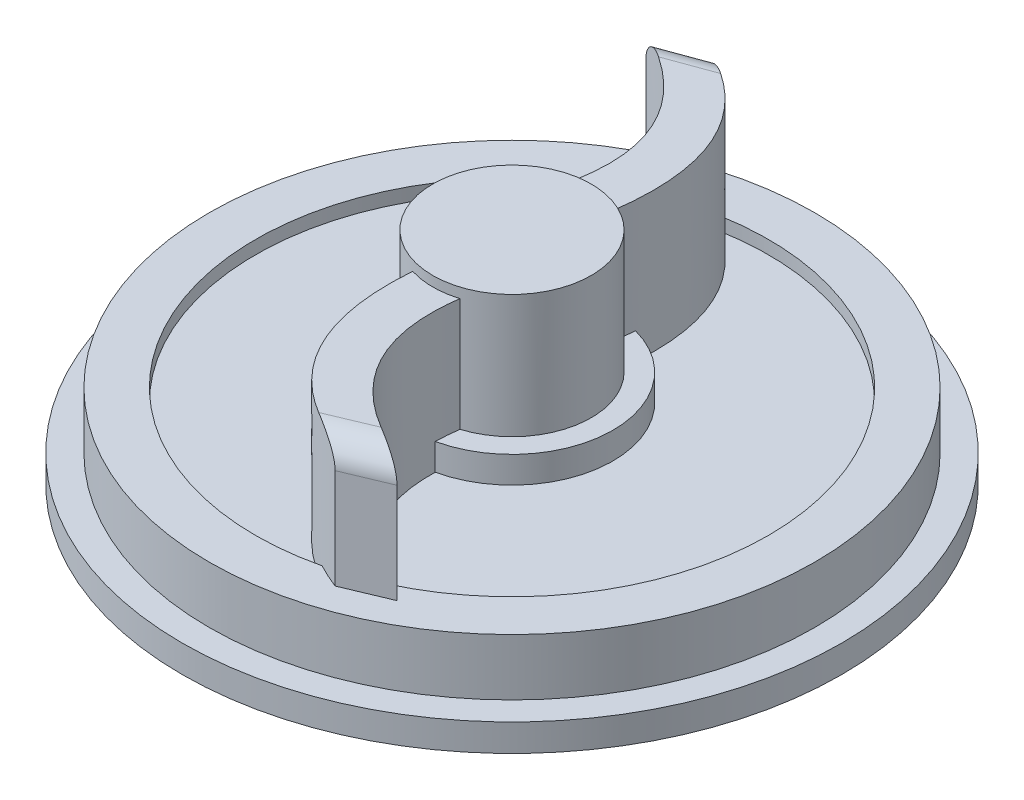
ISO-10303-21;
HEADER;
FILE_DESCRIPTION(('STEP AP214'),'2;1');
FILE_NAME('part.step','',(''),(''),'','','');
FILE_SCHEMA(('AUTOMOTIVE_DESIGN { 1 0 10303 214 1 1 1 1 }'));
ENDSEC;
DATA;
#1=APPLICATION_CONTEXT('core data for automotive mechanical design processes');
#2=APPLICATION_PROTOCOL_DEFINITION('international standard','automotive_design',2000,#1);
#3=PRODUCT_CONTEXT('',#1,'mechanical');
#4=PRODUCT('Part','Part','',(#3));
#5=PRODUCT_RELATED_PRODUCT_CATEGORY('part','',(#4));
#6=PRODUCT_DEFINITION_FORMATION('','',#4);
#7=PRODUCT_DEFINITION_CONTEXT('part definition',#1,'design');
#8=PRODUCT_DEFINITION('design','',#6,#7);
#9=PRODUCT_DEFINITION_SHAPE('','',#8);
#10=(LENGTH_UNIT() NAMED_UNIT(*) SI_UNIT(.MILLI.,.METRE.));
#11=(NAMED_UNIT(*) PLANE_ANGLE_UNIT() SI_UNIT($,.RADIAN.));
#12=(NAMED_UNIT(*) SI_UNIT($,.STERADIAN.) SOLID_ANGLE_UNIT());
#13=UNCERTAINTY_MEASURE_WITH_UNIT(LENGTH_MEASURE(1.E-05),#10,'distance_accuracy_value','');
#14=(GEOMETRIC_REPRESENTATION_CONTEXT(3) GLOBAL_UNCERTAINTY_ASSIGNED_CONTEXT((#13)) GLOBAL_UNIT_ASSIGNED_CONTEXT((#10,
#11,#12)) REPRESENTATION_CONTEXT('',''));
#15=CARTESIAN_POINT('',(0.,0.,0.));
#16=DIRECTION('',(0.,0.,1.));
#17=DIRECTION('',(1.,0.,0.));
#18=AXIS2_PLACEMENT_3D('',#15,#16,#17);
#19=CARTESIAN_POINT('',(-2.19994553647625,7.01039999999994,-9.2856290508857));
#20=DIRECTION('',(-0.939375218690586,0.,0.342890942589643));
#21=DIRECTION('',(0.342890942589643,0.,0.939375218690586));
#22=AXIS2_PLACEMENT_3D('',#19,#20,#21);
#23=CYLINDRICAL_SURFACE('',#22,1.016);
#24=DIRECTION('',(-0.939375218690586,0.,0.342890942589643));
#25=VECTOR('',#24,1.);
#26=CARTESIAN_POINT('',(-2.19994553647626,8.0264,-9.2856290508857));
#27=LINE('',#26,#25);
#28=CARTESIAN_POINT('',(-1.5618017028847,8.0264,-9.51856444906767));
#29=VERTEX_POINT('',#28);
#30=CARTESIAN_POINT('',(-3.29673498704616,8.0264,-8.88527873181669));
#31=VERTEX_POINT('',#30);
#32=EDGE_CURVE('E336',#29,#31,#27,.T.);
#33=ORIENTED_EDGE('',*,*,#32,.F.);
#34=CARTESIAN_POINT('',(-2.7509307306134,7.01039999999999,-10.1660782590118));
#35=CARTESIAN_POINT('',(-2.75093988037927,7.03324762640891,-10.1660813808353));
#36=CARTESIAN_POINT('',(-2.74991310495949,7.05608979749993,-10.1656295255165));
#37=CARTESIAN_POINT('',(-2.74585831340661,7.101539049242,-10.1638402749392));
#38=CARTESIAN_POINT('',(-2.74283226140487,7.12414633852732,-10.1625037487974));
#39=CARTESIAN_POINT('',(-2.73488806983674,7.1687295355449,-10.1589866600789));
#40=CARTESIAN_POINT('',(-2.72998860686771,7.19070944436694,-10.156814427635));
#41=CARTESIAN_POINT('',(-2.71841896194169,7.23409880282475,-10.1516676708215));
#42=CARTESIAN_POINT('',(-2.71174844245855,7.2555081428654,-10.1486929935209));
#43=CARTESIAN_POINT('',(-2.6893457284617,7.31850842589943,-10.1386612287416));
#44=CARTESIAN_POINT('',(-2.67118326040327,7.35907975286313,-10.1304793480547));
#45=CARTESIAN_POINT('',(-2.62959695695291,7.43682199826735,-10.111521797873));
#46=CARTESIAN_POINT('',(-2.60615907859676,7.47398346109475,-10.1007391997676));
#47=CARTESIAN_POINT('',(-2.54341022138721,7.56094330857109,-10.071461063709));
#48=CARTESIAN_POINT('',(-2.50177076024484,7.60863975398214,-10.0517044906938));
#49=CARTESIAN_POINT('',(-2.41260796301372,7.6961262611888,-10.0083441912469));
#50=CARTESIAN_POINT('',(-2.36507192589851,7.73589875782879,-9.9847321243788));
#51=CARTESIAN_POINT('',(-2.25060003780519,7.81905273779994,-9.92631224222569));
#52=CARTESIAN_POINT('',(-2.18225386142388,7.85965759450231,-9.89031505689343));
#53=CARTESIAN_POINT('',(-2.042000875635,7.92795943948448,-9.81351295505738));
#54=CARTESIAN_POINT('',(-1.97009407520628,7.95565646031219,-9.77270805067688));
#55=CARTESIAN_POINT('',(-1.84167675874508,7.99308049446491,-9.69679803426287));
#56=CARTESIAN_POINT('',(-1.78543052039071,8.00547589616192,-9.66254169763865));
#57=CARTESIAN_POINT('',(-1.67321876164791,8.02210958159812,-9.59200145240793));
#58=CARTESIAN_POINT('',(-1.61725289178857,8.02636910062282,-9.55572307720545));
#59=CARTESIAN_POINT('',(-1.5618017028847,8.0264,-9.51856444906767));
#60=B_SPLINE_CURVE_WITH_KNOTS('',3,(#34,#35,#36,#37,#38,#39,#40,#41,#42,#43,#44,#45,#46,#47,#48,
#49,#50,#51,#52,#53,#54,#55,#56,#57,#58,#59),.UNSPECIFIED.,.F.,.F.,(4,2,2,2,2,2,2,2,2,2,2,2,4),
(0.,0.06850652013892,0.13694583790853,0.204719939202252,0.272506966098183,0.407452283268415,
0.542761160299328,0.740634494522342,0.938941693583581,1.19940995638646,1.45987756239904,
1.66041474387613,1.8604277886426),.UNSPECIFIED.);
#61=CARTESIAN_POINT('',(-2.7509307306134,7.01039999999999,-10.1660782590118));
#62=VERTEX_POINT('',#61);
#63=EDGE_CURVE('E63',#62,#29,#60,.T.);
#64=ORIENTED_EDGE('',*,*,#63,.F.);
#65=DIRECTION('',(-0.939375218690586,0.,0.342890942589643));
#66=VECTOR('',#65,1.);
#67=CARTESIAN_POINT('',(-4.44499999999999,7.0104,-9.5477087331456));
#68=LINE('',#67,#66);
#69=CARTESIAN_POINT('',(-4.44499999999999,7.0104,-9.5477087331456));
#70=VERTEX_POINT('',#69);
#71=EDGE_CURVE('E333',#70,#62,#68,.F.);
#72=ORIENTED_EDGE('',*,*,#71,.F.);
#73=CARTESIAN_POINT('',(-3.29673498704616,8.0264,-8.88527873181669));
#74=CARTESIAN_POINT('',(-3.33236763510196,8.02639372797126,-8.9092731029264));
#75=CARTESIAN_POINT('',(-3.36815982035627,8.02461645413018,-8.93298332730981));
#76=CARTESIAN_POINT('',(-3.43984134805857,8.01760239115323,-8.97973016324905));
#77=CARTESIAN_POINT('',(-3.47573068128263,8.01236591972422,-9.00276683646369));
#78=CARTESIAN_POINT('',(-3.58371517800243,7.99149549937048,-9.071027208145));
#79=CARTESIAN_POINT('',(-3.655629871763,7.97070257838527,-9.11506775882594));
#80=CARTESIAN_POINT('',(-3.79884720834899,7.91495059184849,-9.20035419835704));
#81=CARTESIAN_POINT('',(-3.87006333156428,7.87957634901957,-9.24147283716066));
#82=CARTESIAN_POINT('',(-4.00653363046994,7.79454853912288,-9.31828740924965));
#83=CARTESIAN_POINT('',(-4.07180692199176,7.74494305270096,-9.35400099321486));
#84=CARTESIAN_POINT('',(-4.17037473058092,7.65175548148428,-9.40682087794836));
#85=CARTESIAN_POINT('',(-4.2066848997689,7.61250708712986,-9.42597964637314));
#86=CARTESIAN_POINT('',(-4.27361700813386,7.52806614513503,-9.46089832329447));
#87=CARTESIAN_POINT('',(-4.30424677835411,7.4828819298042,-9.47666291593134));
#88=CARTESIAN_POINT('',(-4.35296199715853,7.39579354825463,-9.5015243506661));
#89=CARTESIAN_POINT('',(-4.37231709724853,7.35480033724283,-9.51131331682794));
#90=CARTESIAN_POINT('',(-4.40472654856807,7.26981235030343,-9.52762695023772));
#91=CARTESIAN_POINT('',(-4.4177941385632,7.22582410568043,-9.53415847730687));
#92=CARTESIAN_POINT('',(-4.43307405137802,7.15300720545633,-9.54177935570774));
#93=CARTESIAN_POINT('',(-4.4375233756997,7.1247496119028,-9.54399304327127));
#94=CARTESIAN_POINT('',(-4.44349583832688,7.06780279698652,-9.54696171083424));
#95=CARTESIAN_POINT('',(-4.44501384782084,7.039112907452,-9.54771413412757));
#96=CARTESIAN_POINT('',(-4.44499999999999,7.0104,-9.5477087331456));
#97=B_SPLINE_CURVE_WITH_KNOTS('',3,(#73,#74,#75,#76,#77,#78,#79,#80,#81,#82,#83,#84,#85,#86,#87,
#88,#89,#90,#91,#92,#93,#94,#95,#96),.UNSPECIFIED.,.F.,.F.,(4,2,2,2,2,2,2,2,2,2,2,4),(0.,
0.128788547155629,0.257565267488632,0.516893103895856,0.78417976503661,1.05057381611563,
1.22041156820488,1.39001341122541,1.52860333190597,1.66690015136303,1.75279745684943,
1.8388449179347),.UNSPECIFIED.);
#98=EDGE_CURVE('E11',#31,#70,#97,.T.);
#99=ORIENTED_EDGE('',*,*,#98,.F.);
#100=EDGE_LOOP('',(#33,#64,#72,#99));
#101=FACE_BOUND('',#100,.T.);
#102=ADVANCED_FACE('F49',(#101),#23,.T.);
#103=CARTESIAN_POINT('',(0.950999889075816,7.0104,9.76713718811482));
#104=DIRECTION('',(0.922255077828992,0.,-0.386581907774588));
#105=DIRECTION('',(-0.386581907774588,0.,-0.922255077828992));
#106=AXIS2_PLACEMENT_3D('',#103,#104,#105);
#107=CYLINDRICAL_SURFACE('',#106,1.016);
#108=DIRECTION('',(0.922255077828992,0.,-0.386581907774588));
#109=VECTOR('',#108,1.);
#110=CARTESIAN_POINT('',(0.950999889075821,8.02640000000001,9.76713718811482));
#111=LINE('',#110,#109);
#112=CARTESIAN_POINT('',(1.96858929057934,8.0264,9.34059396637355));
#113=VERTEX_POINT('',#112);
#114=CARTESIAN_POINT('',(3.64632829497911,8.0264,8.63733565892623));
#115=VERTEX_POINT('',#114);
#116=EDGE_CURVE('E527',#113,#115,#111,.T.);
#117=ORIENTED_EDGE('',*,*,#116,.F.);
#118=CARTESIAN_POINT('',(3.18554190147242,7.0104,9.93213111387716));
#119=CARTESIAN_POINT('',(3.18555110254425,7.03327480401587,9.93213381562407));
#120=CARTESIAN_POINT('',(3.18450582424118,7.05614420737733,9.93172800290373));
#121=CARTESIAN_POINT('',(3.1803773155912,7.10164853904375,9.93012051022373));
#122=CARTESIAN_POINT('',(3.1772960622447,7.12428367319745,9.92891960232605));
#123=CARTESIAN_POINT('',(3.16920556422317,7.16892460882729,9.92575832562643));
#124=CARTESIAN_POINT('',(3.16421520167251,7.19093437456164,9.92380539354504));
#125=CARTESIAN_POINT('',(3.15242874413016,7.23438383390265,9.91917630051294));
#126=CARTESIAN_POINT('',(3.14563230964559,7.25582341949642,9.91650000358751));
#127=CARTESIAN_POINT('',(3.1228011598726,7.31891635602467,9.90746971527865));
#128=CARTESIAN_POINT('',(3.10428519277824,7.35955016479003,9.90009917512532));
#129=CARTESIAN_POINT('',(3.06186787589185,7.43741160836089,9.882999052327));
#130=CARTESIAN_POINT('',(3.03795227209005,7.47462985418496,9.87326322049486));
#131=CARTESIAN_POINT('',(2.97398400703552,7.56158899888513,9.8468276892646));
#132=CARTESIAN_POINT('',(2.93156172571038,7.60924136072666,9.82898229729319));
#133=CARTESIAN_POINT('',(2.84065853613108,7.69664323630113,9.78973328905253));
#134=CARTESIAN_POINT('',(2.79216465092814,7.73637533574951,9.76832201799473));
#135=CARTESIAN_POINT('',(2.67532787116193,7.81940872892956,9.71524690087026));
#136=CARTESIAN_POINT('',(2.60552085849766,7.85993928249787,9.68247095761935));
#137=CARTESIAN_POINT('',(2.46210265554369,7.92810604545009,9.61234344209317));
#138=CARTESIAN_POINT('',(2.38849130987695,7.95574172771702,9.57499168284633));
#139=CARTESIAN_POINT('',(2.25674847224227,7.99311633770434,9.50526176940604));
#140=CARTESIAN_POINT('',(2.19892509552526,8.00550228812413,9.47369859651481));
#141=CARTESIAN_POINT('',(2.08344443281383,8.02211787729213,9.40857792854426));
#142=CARTESIAN_POINT('',(2.02578711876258,8.0263693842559,9.375026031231));
#143=CARTESIAN_POINT('',(1.96858929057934,8.0264,9.34059396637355));
#144=B_SPLINE_CURVE_WITH_KNOTS('',3,(#118,#119,#120,#121,#122,#123,#124,#125,#126,#127,#128,
#129,#130,#131,#132,#133,#134,#135,#136,#137,#138,#139,#140,#141,#142,#143),.UNSPECIFIED.,.F.,
.F.,(4,2,2,2,2,2,2,2,2,2,2,2,4),(0.,0.0685881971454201,0.137109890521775,0.204970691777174,
0.272844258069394,0.407968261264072,0.543453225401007,0.741096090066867,0.939168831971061,
1.19919540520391,1.45923260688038,1.65982486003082,1.85987708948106),.UNSPECIFIED.);
#145=CARTESIAN_POINT('',(3.18554190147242,7.0104,9.93213111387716));
#146=VERTEX_POINT('',#145);
#147=EDGE_CURVE('E348',#146,#113,#144,.T.);
#148=ORIENTED_EDGE('',*,*,#147,.F.);
#149=DIRECTION('',(0.922255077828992,0.,-0.386581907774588));
#150=VECTOR('',#149,1.);
#151=CARTESIAN_POINT('',(4.84873670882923,7.01040000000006,9.23496930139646));
#152=LINE('',#151,#150);
#153=CARTESIAN_POINT('',(4.84873670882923,7.01040000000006,9.23496930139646));
#154=VERTEX_POINT('',#153);
#155=EDGE_CURVE('E530',#154,#146,#152,.F.);
#156=ORIENTED_EDGE('',*,*,#155,.F.);
#157=CARTESIAN_POINT('',(3.64632829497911,8.0264,8.63733565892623));
#158=CARTESIAN_POINT('',(3.68325949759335,8.02639381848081,8.65922942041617));
#159=CARTESIAN_POINT('',(3.72034227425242,8.02464609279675,8.68081700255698));
#160=CARTESIAN_POINT('',(3.79458801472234,8.01775614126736,8.72329115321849));
#161=CARTESIAN_POINT('',(3.83175096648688,8.01261439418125,8.7441778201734));
#162=CARTESIAN_POINT('',(3.94355428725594,7.99213627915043,8.80594597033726));
#163=CARTESIAN_POINT('',(4.01799263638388,7.97174924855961,8.84563055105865));
#164=CARTESIAN_POINT('',(4.16771501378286,7.9166246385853,8.92295520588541));
#165=CARTESIAN_POINT('',(4.24285721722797,7.88122422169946,8.96039565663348));
#166=CARTESIAN_POINT('',(4.38696363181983,7.79592522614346,9.03008862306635));
#167=CARTESIAN_POINT('',(4.45594730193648,7.74607459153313,9.06235775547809));
#168=CARTESIAN_POINT('',(4.55954582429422,7.65279499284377,9.10963659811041));
#169=CARTESIAN_POINT('',(4.59738089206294,7.61390951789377,9.12659381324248));
#170=CARTESIAN_POINT('',(4.66728118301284,7.53018304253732,9.15750580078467));
#171=CARTESIAN_POINT('',(4.69935461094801,7.48535067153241,9.17146484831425));
#172=CARTESIAN_POINT('',(4.75033811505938,7.39914374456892,9.19343005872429));
#173=CARTESIAN_POINT('',(4.77059110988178,7.35872696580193,9.20206317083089));
#174=CARTESIAN_POINT('',(4.80470336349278,7.27484021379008,9.21652061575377));
#175=CARTESIAN_POINT('',(4.81857669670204,7.23137720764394,9.2223511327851));
#176=CARTESIAN_POINT('',(4.83529785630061,7.15811414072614,9.22935950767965));
#177=CARTESIAN_POINT('',(4.84030713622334,7.12888242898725,9.23145243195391));
#178=CARTESIAN_POINT('',(4.84703969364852,7.06991008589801,9.23426190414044));
#179=CARTESIAN_POINT('',(4.84875519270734,7.04016841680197,9.23497519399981));
#180=CARTESIAN_POINT('',(4.84873670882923,7.01040000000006,9.23496930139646));
#181=B_SPLINE_CURVE_WITH_KNOTS('',3,(#157,#158,#159,#160,#161,#162,#163,#164,#165,#166,#167,
#168,#169,#170,#171,#172,#173,#174,#175,#176,#177,#178,#179,#180),.UNSPECIFIED.,.F.,.F.,(4,2,2,
2,2,2,2,2,2,2,2,4),(0.,0.128715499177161,0.257412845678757,0.516586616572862,0.788640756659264,
1.0598023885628,1.22979338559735,1.39954035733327,1.53708153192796,1.67431779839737,
1.76330802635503,1.85250815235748),.UNSPECIFIED.);
#182=EDGE_CURVE('E340',#115,#154,#181,.T.);
#183=ORIENTED_EDGE('',*,*,#182,.F.);
#184=EDGE_LOOP('',(#117,#148,#156,#183));
#185=FACE_BOUND('',#184,.T.);
#186=ADVANCED_FACE('F355',(#185),#107,.T.);
#187=CARTESIAN_POINT('',(0.,3.2004,0.));
#188=DIRECTION('',(0.,1.,0.));
#189=DIRECTION('',(0.,0.,1.));
#190=AXIS2_PLACEMENT_3D('',#187,#188,#189);
#191=PLANE('',#190);
#192=CARTESIAN_POINT('',(0.,3.2004,0.));
#193=DIRECTION('',(0.,1.,0.));
#194=DIRECTION('',(0.,0.,1.));
#195=AXIS2_PLACEMENT_3D('',#192,#193,#194);
#196=CIRCLE('',#195,11.5443);
#197=CARTESIAN_POINT('',(0.,3.2004,11.5443));
#198=VERTEX_POINT('',#197);
#199=EDGE_CURVE('E491',#198,#198,#196,.T.);
#200=ORIENTED_EDGE('',*,*,#199,.T.);
#201=EDGE_LOOP('',(#200));
#202=FACE_BOUND('',#201,.T.);
#203=CARTESIAN_POINT('',(0.,3.2004,0.));
#204=DIRECTION('',(0.,1.,0.));
#205=DIRECTION('',(0.,0.,1.));
#206=AXIS2_PLACEMENT_3D('',#203,#204,#205);
#207=CIRCLE('',#206,9.779);
#208=CARTESIAN_POINT('',(-3.61147269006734,3.20039999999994,-9.08768980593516));
#209=VERTEX_POINT('',#208);
#210=CARTESIAN_POINT('',(2.26973813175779,3.20040000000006,9.51194668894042));
#211=VERTEX_POINT('',#210);
#212=EDGE_CURVE('E481',#209,#211,#207,.T.);
#213=ORIENTED_EDGE('',*,*,#212,.F.);
#214=CARTESIAN_POINT('',(-4.445,3.2004,-9.5477087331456));
#215=CARTESIAN_POINT('',(0.127,3.2004,-7.27700557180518));
#216=CARTESIAN_POINT('',(-0.9017,3.2004,-2.88496930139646));
#217=B_SPLINE_CURVE_WITH_KNOTS('',2,(#214,#215,#216),.UNSPECIFIED.,.F.,.F.,(3,3),(0.,1.),.UNSPECIFIED.);
#218=CARTESIAN_POINT('',(-4.445,3.2004,-9.5477087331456));
#219=VERTEX_POINT('',#218);
#220=EDGE_CURVE('E391',#209,#219,#217,.F.);
#221=ORIENTED_EDGE('',*,*,#220,.T.);
#222=DIRECTION('',(0.939375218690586,0.,-0.342890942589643));
#223=VECTOR('',#222,1.);
#224=CARTESIAN_POINT('',(-3.59796536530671,3.20039999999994,-9.85689349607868));
#225=LINE('',#224,#223);
#226=CARTESIAN_POINT('',(-2.7509307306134,3.2004,-10.1660782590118));
#227=VERTEX_POINT('',#226);
#228=EDGE_CURVE('E523',#219,#227,#225,.T.);
#229=ORIENTED_EDGE('',*,*,#228,.T.);
#230=CARTESIAN_POINT('',(0.901700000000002,3.2004,-2.88496930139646));
#231=CARTESIAN_POINT('',(1.66484130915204,3.2004,-8.21896930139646));
#232=CARTESIAN_POINT('',(-2.7509307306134,3.2004,-10.1660782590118));
#233=B_SPLINE_CURVE_WITH_KNOTS('',2,(#230,#231,#232),.UNSPECIFIED.,.F.,.F.,(3,3),(0.,1.),.UNSPECIFIED.);
#234=CARTESIAN_POINT('',(-1.7263644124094,3.2004,-9.6254094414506));
#235=VERTEX_POINT('',#234);
#236=EDGE_CURVE('E561',#227,#235,#233,.F.);
#237=ORIENTED_EDGE('',*,*,#236,.T.);
#238=CARTESIAN_POINT('',(4.08978503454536,3.2004,8.88270788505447));
#239=VERTEX_POINT('',#238);
#240=EDGE_CURVE('E493',#239,#235,#207,.T.);
#241=ORIENTED_EDGE('',*,*,#240,.F.);
#242=CARTESIAN_POINT('',(4.84873670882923,3.20040000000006,9.23496930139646));
#243=CARTESIAN_POINT('',(0.276736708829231,3.2004,7.32908113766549));
#244=CARTESIAN_POINT('',(0.9017,3.2004,2.88496930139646));
#245=B_SPLINE_CURVE_WITH_KNOTS('',2,(#242,#243,#244),.UNSPECIFIED.,.F.,.F.,(3,3),(0.,1.),.UNSPECIFIED.);
#246=CARTESIAN_POINT('',(4.84873670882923,3.20040000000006,9.23496930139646));
#247=VERTEX_POINT('',#246);
#248=EDGE_CURVE('E431',#239,#247,#245,.F.);
#249=ORIENTED_EDGE('',*,*,#248,.T.);
#250=DIRECTION('',(-0.922255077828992,0.,0.386581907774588));
#251=VECTOR('',#250,1.);
#252=CARTESIAN_POINT('',(4.01713930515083,3.2004,9.58355020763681));
#253=LINE('',#252,#251);
#254=CARTESIAN_POINT('',(3.18554190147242,3.2004,9.93213111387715));
#255=VERTEX_POINT('',#254);
#256=EDGE_CURVE('E515',#247,#255,#253,.T.);
#257=ORIENTED_EDGE('',*,*,#256,.T.);
#258=CARTESIAN_POINT('',(-0.901699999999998,3.20039999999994,2.88496930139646));
#259=CARTESIAN_POINT('',(-1.31205563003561,3.2004,8.1823047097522));
#260=CARTESIAN_POINT('',(3.18554190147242,3.2004,9.93213111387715));
#261=B_SPLINE_CURVE_WITH_KNOTS('',2,(#258,#259,#260),.UNSPECIFIED.,.F.,.F.,(3,3),(0.,1.),.UNSPECIFIED.);
#262=EDGE_CURVE('E457',#255,#211,#261,.F.);
#263=ORIENTED_EDGE('',*,*,#262,.T.);
#264=EDGE_LOOP('',(#213,#221,#229,#237,#241,#249,#257,#263));
#265=FACE_BOUND('',#264,.T.);
#266=ADVANCED_FACE('F609',(#202,#265),#191,.T.);
#267=CARTESIAN_POINT('',(0.,2.6924,0.));
#268=DIRECTION('',(0.,1.,0.));
#269=DIRECTION('',(0.,0.,1.));
#270=AXIS2_PLACEMENT_3D('',#267,#268,#269);
#271=CYLINDRICAL_SURFACE('',#270,9.779);
#272=DIRECTION('',(0.,-1.,0.));
#273=VECTOR('',#272,1.);
#274=CARTESIAN_POINT('',(-3.61147269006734,8.0264,-9.08768980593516));
#275=LINE('',#274,#273);
#276=CARTESIAN_POINT('',(-3.61147269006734,2.69239999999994,-9.08768980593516));
#277=VERTEX_POINT('',#276);
#278=EDGE_CURVE('E551',#209,#277,#275,.T.);
#279=ORIENTED_EDGE('',*,*,#278,.F.);
#280=ORIENTED_EDGE('',*,*,#212,.T.);
#281=DIRECTION('',(0.,-1.,0.));
#282=VECTOR('',#281,1.);
#283=CARTESIAN_POINT('',(2.26973813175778,8.0264,9.51194668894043));
#284=LINE('',#283,#282);
#285=CARTESIAN_POINT('',(2.26973813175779,2.69240000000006,9.51194668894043));
#286=VERTEX_POINT('',#285);
#287=EDGE_CURVE('E453',#286,#211,#284,.F.);
#288=ORIENTED_EDGE('',*,*,#287,.F.);
#289=CARTESIAN_POINT('',(0.,2.6924,0.));
#290=DIRECTION('',(0.,1.,0.));
#291=DIRECTION('',(0.,0.,1.));
#292=AXIS2_PLACEMENT_3D('',#289,#290,#291);
#293=CIRCLE('',#292,9.779);
#294=EDGE_CURVE('E492',#277,#286,#293,.T.);
#295=ORIENTED_EDGE('',*,*,#294,.F.);
#296=EDGE_LOOP('',(#279,#280,#288,#295));
#297=FACE_BOUND('',#296,.T.);
#298=ADVANCED_FACE('F606',(#297),#271,.F.);
#299=DIRECTION('',(0.,-1.,0.));
#300=VECTOR('',#299,1.);
#301=CARTESIAN_POINT('',(-1.72636441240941,8.0264,-9.62540944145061));
#302=LINE('',#301,#300);
#303=CARTESIAN_POINT('',(-1.72636441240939,2.6924,-9.6254094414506));
#304=VERTEX_POINT('',#303);
#305=EDGE_CURVE('E564',#304,#235,#302,.F.);
#306=ORIENTED_EDGE('',*,*,#305,.F.);
#307=CARTESIAN_POINT('',(4.08978503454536,2.6924,8.88270788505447));
#308=VERTEX_POINT('',#307);
#309=EDGE_CURVE('E487',#308,#304,#293,.T.);
#310=ORIENTED_EDGE('',*,*,#309,.F.);
#311=DIRECTION('',(0.,-1.,0.));
#312=VECTOR('',#311,1.);
#313=CARTESIAN_POINT('',(4.08978503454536,8.0264,8.88270788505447));
#314=LINE('',#313,#312);
#315=EDGE_CURVE('E427',#239,#308,#314,.T.);
#316=ORIENTED_EDGE('',*,*,#315,.F.);
#317=ORIENTED_EDGE('',*,*,#240,.T.);
#318=EDGE_LOOP('',(#306,#310,#316,#317));
#319=FACE_BOUND('',#318,.T.);
#320=ADVANCED_FACE('F641',(#319),#271,.F.);
#321=CARTESIAN_POINT('',(0.,2.6924,0.));
#322=DIRECTION('',(0.,1.,0.));
#323=DIRECTION('',(0.,0.,1.));
#324=AXIS2_PLACEMENT_3D('',#321,#322,#323);
#325=PLANE('',#324);
#326=CARTESIAN_POINT('',(0.,2.6924,0.));
#327=DIRECTION('',(0.,1.,0.));
#328=DIRECTION('',(0.,0.,1.));
#329=AXIS2_PLACEMENT_3D('',#326,#327,#328);
#330=CIRCLE('',#329,3.8481);
#331=CARTESIAN_POINT('',(-0.748409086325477,2.69240000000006,-3.77462017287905));
#332=VERTEX_POINT('',#331);
#333=CARTESIAN_POINT('',(-0.936001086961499,2.6924,3.73252938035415));
#334=VERTEX_POINT('',#333);
#335=EDGE_CURVE('E470',#332,#334,#330,.T.);
#336=ORIENTED_EDGE('',*,*,#335,.F.);
#337=CARTESIAN_POINT('',(-4.445,2.6924,-9.5477087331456));
#338=CARTESIAN_POINT('',(0.127000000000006,2.6924,-7.27700557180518));
#339=CARTESIAN_POINT('',(-0.901699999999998,2.6924,-2.88496930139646));
#340=B_SPLINE_CURVE_WITH_KNOTS('',2,(#337,#338,#339),.UNSPECIFIED.,.F.,.F.,(3,3),(0.,1.),.UNSPECIFIED.);
#341=EDGE_CURVE('E289',#277,#332,#340,.T.);
#342=ORIENTED_EDGE('',*,*,#341,.F.);
#343=ORIENTED_EDGE('',*,*,#294,.T.);
#344=CARTESIAN_POINT('',(-0.901700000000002,2.69239999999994,2.88496930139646));
#345=CARTESIAN_POINT('',(-1.3120556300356,2.6924,8.1823047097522));
#346=CARTESIAN_POINT('',(3.18554190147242,2.6924,9.93213111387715));
#347=B_SPLINE_CURVE_WITH_KNOTS('',2,(#344,#345,#346),.UNSPECIFIED.,.F.,.F.,(3,3),(0.,1.),.UNSPECIFIED.);
#348=EDGE_CURVE('E381',#334,#286,#347,.T.);
#349=ORIENTED_EDGE('',*,*,#348,.F.);
#350=EDGE_LOOP('',(#336,#342,#343,#349));
#351=FACE_BOUND('',#350,.T.);
#352=ADVANCED_FACE('F598',(#351),#325,.T.);
#353=ORIENTED_EDGE('',*,*,#309,.T.);
#354=CARTESIAN_POINT('',(0.901700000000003,2.6924,-2.88496930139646));
#355=CARTESIAN_POINT('',(1.66484130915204,2.6924,-8.21896930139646));
#356=CARTESIAN_POINT('',(-2.75093073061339,2.6924,-10.1660782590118));
#357=B_SPLINE_CURVE_WITH_KNOTS('',2,(#354,#355,#356),.UNSPECIFIED.,.F.,.F.,(3,3),(0.,1.),.UNSPECIFIED.);
#358=CARTESIAN_POINT('',(0.990769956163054,2.6924,-3.71836637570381));
#359=VERTEX_POINT('',#358);
#360=EDGE_CURVE('E283',#359,#304,#357,.T.);
#361=ORIENTED_EDGE('',*,*,#360,.F.);
#362=CARTESIAN_POINT('',(0.828445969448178,2.69239999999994,3.75786520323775));
#363=VERTEX_POINT('',#362);
#364=EDGE_CURVE('E483',#363,#359,#330,.T.);
#365=ORIENTED_EDGE('',*,*,#364,.F.);
#366=CARTESIAN_POINT('',(4.84873670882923,2.69240000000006,9.23496930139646));
#367=CARTESIAN_POINT('',(0.276736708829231,2.6924,7.32908113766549));
#368=CARTESIAN_POINT('',(0.901699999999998,2.6924,2.88496930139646));
#369=B_SPLINE_CURVE_WITH_KNOTS('',2,(#366,#367,#368),.UNSPECIFIED.,.F.,.F.,(3,3),(0.,1.),.UNSPECIFIED.);
#370=EDGE_CURVE('E390',#308,#363,#369,.T.);
#371=ORIENTED_EDGE('',*,*,#370,.F.);
#372=EDGE_LOOP('',(#353,#361,#365,#371));
#373=FACE_BOUND('',#372,.T.);
#374=ADVANCED_FACE('F680',(#373),#325,.T.);
#375=CARTESIAN_POINT('',(0.,3.7084,0.));
#376=DIRECTION('',(0.,-1.,0.));
#377=DIRECTION('',(0.,0.,-1.));
#378=AXIS2_PLACEMENT_3D('',#375,#376,#377);
#379=CYLINDRICAL_SURFACE('',#378,3.8481);
#380=DIRECTION('',(0.,-1.,0.));
#381=VECTOR('',#380,1.);
#382=CARTESIAN_POINT('',(-0.748409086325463,8.02639999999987,-3.77462017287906));
#383=LINE('',#382,#381);
#384=CARTESIAN_POINT('',(-0.748409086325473,3.70840000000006,-3.77462017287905));
#385=VERTEX_POINT('',#384);
#386=EDGE_CURVE('E554',#332,#385,#383,.F.);
#387=ORIENTED_EDGE('',*,*,#386,.F.);
#388=ORIENTED_EDGE('',*,*,#335,.T.);
#389=DIRECTION('',(0.,-1.,0.));
#390=VECTOR('',#389,1.);
#391=CARTESIAN_POINT('',(-0.936001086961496,8.0264,3.73252938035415));
#392=LINE('',#391,#390);
#393=CARTESIAN_POINT('',(-0.936001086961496,3.70839999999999,3.73252938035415));
#394=VERTEX_POINT('',#393);
#395=EDGE_CURVE('E446',#394,#334,#392,.T.);
#396=ORIENTED_EDGE('',*,*,#395,.F.);
#397=CARTESIAN_POINT('',(0.,3.7084,0.));
#398=DIRECTION('',(0.,1.,0.));
#399=DIRECTION('',(0.,0.,1.));
#400=AXIS2_PLACEMENT_3D('',#397,#398,#399);
#401=CIRCLE('',#400,3.8481);
#402=EDGE_CURVE('E482',#385,#394,#401,.T.);
#403=ORIENTED_EDGE('',*,*,#402,.F.);
#404=EDGE_LOOP('',(#387,#388,#396,#403));
#405=FACE_BOUND('',#404,.T.);
#406=ADVANCED_FACE('F590',(#405),#379,.T.);
#407=DIRECTION('',(0.,-1.,0.));
#408=VECTOR('',#407,1.);
#409=CARTESIAN_POINT('',(0.990769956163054,8.0264,-3.71836637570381));
#410=LINE('',#409,#408);
#411=CARTESIAN_POINT('',(0.990769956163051,3.7084,-3.71836637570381));
#412=VERTEX_POINT('',#411);
#413=EDGE_CURVE('E568',#412,#359,#410,.T.);
#414=ORIENTED_EDGE('',*,*,#413,.F.);
#415=CARTESIAN_POINT('',(0.828445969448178,3.70839999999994,3.75786520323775));
#416=VERTEX_POINT('',#415);
#417=EDGE_CURVE('E477',#416,#412,#401,.T.);
#418=ORIENTED_EDGE('',*,*,#417,.F.);
#419=DIRECTION('',(0.,-1.,0.));
#420=VECTOR('',#419,1.);
#421=CARTESIAN_POINT('',(0.828445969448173,8.02640000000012,3.75786520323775));
#422=LINE('',#421,#420);
#423=EDGE_CURVE('E420',#363,#416,#422,.F.);
#424=ORIENTED_EDGE('',*,*,#423,.F.);
#425=ORIENTED_EDGE('',*,*,#364,.T.);
#426=EDGE_LOOP('',(#414,#418,#424,#425));
#427=FACE_BOUND('',#426,.T.);
#428=ADVANCED_FACE('F678',(#427),#379,.T.);
#429=CARTESIAN_POINT('',(0.,3.7084,0.));
#430=DIRECTION('',(0.,1.,0.));
#431=DIRECTION('',(0.,0.,1.));
#432=AXIS2_PLACEMENT_3D('',#429,#430,#431);
#433=PLANE('',#432);
#434=CARTESIAN_POINT('',(0.,3.7084,0.));
#435=DIRECTION('',(0.,1.,0.));
#436=DIRECTION('',(0.,0.,1.));
#437=AXIS2_PLACEMENT_3D('',#434,#435,#436);
#438=CIRCLE('',#437,3.0226);
#439=CARTESIAN_POINT('',(-0.901700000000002,3.7084,-2.88496930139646));
#440=VERTEX_POINT('',#439);
#441=CARTESIAN_POINT('',(-0.901699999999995,3.70839999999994,2.88496930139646));
#442=VERTEX_POINT('',#441);
#443=EDGE_CURVE('E476',#440,#442,#438,.T.);
#444=ORIENTED_EDGE('',*,*,#443,.F.);
#445=CARTESIAN_POINT('',(-4.445,3.7084,-9.5477087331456));
#446=CARTESIAN_POINT('',(0.127000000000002,3.7084,-7.27700557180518));
#447=CARTESIAN_POINT('',(-0.901700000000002,3.7084,-2.88496930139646));
#448=B_SPLINE_CURVE_WITH_KNOTS('',2,(#445,#446,#447),.UNSPECIFIED.,.F.,.F.,(3,3),(0.,1.),.UNSPECIFIED.);
#449=EDGE_CURVE('E558',#440,#385,#448,.F.);
#450=ORIENTED_EDGE('',*,*,#449,.T.);
#451=ORIENTED_EDGE('',*,*,#402,.T.);
#452=CARTESIAN_POINT('',(-0.901699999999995,3.70839999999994,2.88496930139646));
#453=CARTESIAN_POINT('',(-1.31205563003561,3.7084,8.1823047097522));
#454=CARTESIAN_POINT('',(3.18554190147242,3.7084,9.93213111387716));
#455=B_SPLINE_CURVE_WITH_KNOTS('',2,(#452,#453,#454),.UNSPECIFIED.,.F.,.F.,(3,3),(0.,1.),.UNSPECIFIED.);
#456=EDGE_CURVE('E437',#394,#442,#455,.F.);
#457=ORIENTED_EDGE('',*,*,#456,.T.);
#458=EDGE_LOOP('',(#444,#450,#451,#457));
#459=FACE_BOUND('',#458,.T.);
#460=ADVANCED_FACE('F587',(#459),#433,.T.);
#461=ORIENTED_EDGE('',*,*,#417,.T.);
#462=CARTESIAN_POINT('',(0.901700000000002,3.7084,-2.88496930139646));
#463=CARTESIAN_POINT('',(1.66484130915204,3.7084,-8.21896930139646));
#464=CARTESIAN_POINT('',(-2.75093073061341,3.7084,-10.1660782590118));
#465=B_SPLINE_CURVE_WITH_KNOTS('',2,(#462,#463,#464),.UNSPECIFIED.,.F.,.F.,(3,3),(0.,1.),.UNSPECIFIED.);
#466=CARTESIAN_POINT('',(0.901700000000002,3.7084,-2.88496930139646));
#467=VERTEX_POINT('',#466);
#468=EDGE_CURVE('E299',#412,#467,#465,.F.);
#469=ORIENTED_EDGE('',*,*,#468,.T.);
#470=CARTESIAN_POINT('',(0.901699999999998,3.7084,2.88496930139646));
#471=VERTEX_POINT('',#470);
#472=EDGE_CURVE('E471',#471,#467,#438,.T.);
#473=ORIENTED_EDGE('',*,*,#472,.F.);
#474=CARTESIAN_POINT('',(4.84873670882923,3.70840000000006,9.23496930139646));
#475=CARTESIAN_POINT('',(0.276736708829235,3.7084,7.32908113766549));
#476=CARTESIAN_POINT('',(0.901699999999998,3.7084,2.88496930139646));
#477=B_SPLINE_CURVE_WITH_KNOTS('',2,(#474,#475,#476),.UNSPECIFIED.,.F.,.F.,(3,3),(0.,1.),.UNSPECIFIED.);
#478=EDGE_CURVE('E415',#471,#416,#477,.F.);
#479=ORIENTED_EDGE('',*,*,#478,.T.);
#480=EDGE_LOOP('',(#461,#469,#473,#479));
#481=FACE_BOUND('',#480,.T.);
#482=ADVANCED_FACE('F616',(#481),#433,.T.);
#483=CARTESIAN_POINT('',(0.,8.40740000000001,0.));
#484=DIRECTION('',(0.,-1.,0.));
#485=DIRECTION('',(0.,0.,-1.));
#486=AXIS2_PLACEMENT_3D('',#483,#484,#485);
#487=CYLINDRICAL_SURFACE('',#486,3.0226);
#488=CARTESIAN_POINT('',(0.,8.40740000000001,0.));
#489=DIRECTION('',(0.,1.,0.));
#490=DIRECTION('',(0.,0.,1.));
#491=AXIS2_PLACEMENT_3D('',#488,#489,#490);
#492=CIRCLE('',#491,3.0226);
#493=CARTESIAN_POINT('',(0.,8.40740000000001,3.0226));
#494=VERTEX_POINT('',#493);
#495=EDGE_CURVE('E463',#494,#494,#492,.T.);
#496=ORIENTED_EDGE('',*,*,#495,.F.);
#497=EDGE_LOOP('',(#496));
#498=FACE_BOUND('',#497,.T.);
#499=DIRECTION('',(0.,-1.,0.));
#500=VECTOR('',#499,1.);
#501=CARTESIAN_POINT('',(-0.901699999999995,8.02639999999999,-2.88496930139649));
#502=LINE('',#501,#500);
#503=CARTESIAN_POINT('',(-0.901699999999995,8.02639999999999,-2.88496930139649));
#504=VERTEX_POINT('',#503);
#505=EDGE_CURVE('E266',#504,#440,#502,.T.);
#506=ORIENTED_EDGE('',*,*,#505,.T.);
#507=ORIENTED_EDGE('',*,*,#443,.T.);
#508=DIRECTION('',(0.,-1.,0.));
#509=VECTOR('',#508,1.);
#510=CARTESIAN_POINT('',(-0.901700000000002,8.0264,2.88496930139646));
#511=LINE('',#510,#509);
#512=CARTESIAN_POINT('',(-0.901700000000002,8.0264,2.88496930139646));
#513=VERTEX_POINT('',#512);
#514=EDGE_CURVE('E375',#513,#442,#511,.T.);
#515=ORIENTED_EDGE('',*,*,#514,.F.);
#516=CARTESIAN_POINT('',(0.,8.0264,0.));
#517=DIRECTION('',(0.,-1.,0.));
#518=DIRECTION('',(0.,0.,-1.));
#519=AXIS2_PLACEMENT_3D('',#516,#517,#518);
#520=CIRCLE('',#519,3.0226);
#521=CARTESIAN_POINT('',(0.901699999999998,8.0264,2.88496930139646));
#522=VERTEX_POINT('',#521);
#523=EDGE_CURVE('E475',#522,#513,#520,.T.);
#524=ORIENTED_EDGE('',*,*,#523,.F.);
#525=DIRECTION('',(0.,-1.,0.));
#526=VECTOR('',#525,1.);
#527=CARTESIAN_POINT('',(0.901699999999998,8.0264,2.88496930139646));
#528=LINE('',#527,#526);
#529=EDGE_CURVE('E406',#522,#471,#528,.T.);
#530=ORIENTED_EDGE('',*,*,#529,.T.);
#531=ORIENTED_EDGE('',*,*,#472,.T.);
#532=DIRECTION('',(0.,-1.,0.));
#533=VECTOR('',#532,1.);
#534=CARTESIAN_POINT('',(0.901699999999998,8.0264,-2.88496930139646));
#535=LINE('',#534,#533);
#536=CARTESIAN_POINT('',(0.901699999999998,8.0264,-2.88496930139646));
#537=VERTEX_POINT('',#536);
#538=EDGE_CURVE('E272',#537,#467,#535,.T.);
#539=ORIENTED_EDGE('',*,*,#538,.F.);
#540=CARTESIAN_POINT('',(0.,8.0264,0.));
#541=DIRECTION('',(0.,-1.,0.));
#542=DIRECTION('',(0.,0.,-1.));
#543=AXIS2_PLACEMENT_3D('',#540,#541,#542);
#544=CIRCLE('',#543,3.0226);
#545=EDGE_CURVE('E519',#504,#537,#544,.T.);
#546=ORIENTED_EDGE('',*,*,#545,.F.);
#547=EDGE_LOOP('',(#506,#507,#515,#524,#530,#531,#539,#546));
#548=FACE_BOUND('',#547,.T.);
#549=ADVANCED_FACE('F582',(#498,#548),#487,.T.);
#550=CARTESIAN_POINT('',(0.,1.0414,0.));
#551=DIRECTION('',(0.,-1.,0.));
#552=DIRECTION('',(0.,0.,-1.));
#553=AXIS2_PLACEMENT_3D('',#550,#551,#552);
#554=CYLINDRICAL_SURFACE('',#553,12.573);
#555=CARTESIAN_POINT('',(0.,1.0414,0.));
#556=DIRECTION('',(0.,1.,0.));
#557=DIRECTION('',(0.,0.,1.));
#558=AXIS2_PLACEMENT_3D('',#555,#556,#557);
#559=CIRCLE('',#558,12.573);
#560=CARTESIAN_POINT('',(0.,1.0414,12.573));
#561=VERTEX_POINT('',#560);
#562=EDGE_CURVE('E505',#561,#561,#559,.T.);
#563=ORIENTED_EDGE('',*,*,#562,.F.);
#564=EDGE_LOOP('',(#563));
#565=FACE_BOUND('',#564,.T.);
#566=CARTESIAN_POINT('',(0.,0.,0.));
#567=DIRECTION('',(0.,1.,0.));
#568=DIRECTION('',(0.,0.,1.));
#569=AXIS2_PLACEMENT_3D('',#566,#567,#568);
#570=CIRCLE('',#569,12.573);
#571=CARTESIAN_POINT('',(0.,0.,12.573));
#572=VERTEX_POINT('',#571);
#573=EDGE_CURVE('E500',#572,#572,#570,.T.);
#574=ORIENTED_EDGE('',*,*,#573,.T.);
#575=EDGE_LOOP('',(#574));
#576=FACE_BOUND('',#575,.T.);
#577=ADVANCED_FACE('F654',(#565,#576),#554,.T.);
#578=CARTESIAN_POINT('',(0.,1.0414,0.));
#579=DIRECTION('',(0.,1.,0.));
#580=DIRECTION('',(0.,0.,1.));
#581=AXIS2_PLACEMENT_3D('',#578,#579,#580);
#582=PLANE('',#581);
#583=CARTESIAN_POINT('',(0.,1.0414,0.));
#584=DIRECTION('',(0.,1.,0.));
#585=DIRECTION('',(0.,0.,1.));
#586=AXIS2_PLACEMENT_3D('',#583,#584,#585);
#587=CIRCLE('',#586,11.5443);
#588=CARTESIAN_POINT('',(0.,1.0414,11.5443));
#589=VERTEX_POINT('',#588);
#590=EDGE_CURVE('E501',#589,#589,#587,.T.);
#591=ORIENTED_EDGE('',*,*,#590,.F.);
#592=EDGE_LOOP('',(#591));
#593=FACE_BOUND('',#592,.T.);
#594=ORIENTED_EDGE('',*,*,#562,.T.);
#595=EDGE_LOOP('',(#594));
#596=FACE_BOUND('',#595,.T.);
#597=ADVANCED_FACE('F651',(#593,#596),#582,.T.);
#598=CARTESIAN_POINT('',(0.,0.,0.));
#599=DIRECTION('',(0.,1.,0.));
#600=DIRECTION('',(0.,0.,1.));
#601=AXIS2_PLACEMENT_3D('',#598,#599,#600);
#602=PLANE('',#601);
#603=CARTESIAN_POINT('',(0.,0.,0.));
#604=DIRECTION('',(0.,-1.,0.));
#605=DIRECTION('',(0.,0.,-1.));
#606=AXIS2_PLACEMENT_3D('',#603,#604,#605);
#607=CIRCLE('',#606,10.0584);
#608=CARTESIAN_POINT('',(0.,0.,-10.0584));
#609=VERTEX_POINT('',#608);
#610=EDGE_CURVE('E258',#609,#609,#607,.T.);
#611=ORIENTED_EDGE('',*,*,#610,.F.);
#612=EDGE_LOOP('',(#611));
#613=FACE_BOUND('',#612,.T.);
#614=ORIENTED_EDGE('',*,*,#573,.F.);
#615=EDGE_LOOP('',(#614));
#616=FACE_BOUND('',#615,.T.);
#617=ADVANCED_FACE('F649',(#613,#616),#602,.F.);
#618=CARTESIAN_POINT('',(0.,3.2004,0.));
#619=DIRECTION('',(0.,-1.,0.));
#620=DIRECTION('',(0.,0.,-1.));
#621=AXIS2_PLACEMENT_3D('',#618,#619,#620);
#622=CYLINDRICAL_SURFACE('',#621,11.5443);
#623=ORIENTED_EDGE('',*,*,#199,.F.);
#624=EDGE_LOOP('',(#623));
#625=FACE_BOUND('',#624,.T.);
#626=ORIENTED_EDGE('',*,*,#590,.T.);
#627=EDGE_LOOP('',(#626));
#628=FACE_BOUND('',#627,.T.);
#629=ADVANCED_FACE('F645',(#625,#628),#622,.T.);
#630=CARTESIAN_POINT('',(0.,8.40740000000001,0.));
#631=DIRECTION('',(0.,1.,0.));
#632=DIRECTION('',(0.,0.,1.));
#633=AXIS2_PLACEMENT_3D('',#630,#631,#632);
#634=PLANE('',#633);
#635=ORIENTED_EDGE('',*,*,#495,.T.);
#636=EDGE_LOOP('',(#635));
#637=FACE_BOUND('',#636,.T.);
#638=ADVANCED_FACE('F648',(#637),#634,.T.);
#639=CARTESIAN_POINT('',(-0.901700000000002,8.0264,2.88496930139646));
#640=CARTESIAN_POINT('',(-1.3120556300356,8.0264,8.18230470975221));
#641=CARTESIAN_POINT('',(3.18554190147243,8.02640000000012,9.93213111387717));
#642=B_SPLINE_CURVE_WITH_KNOTS('',2,(#639,#640,#641),.UNSPECIFIED.,.F.,.F.,(3,3),(0.,1.),.UNSPECIFIED.);
#643=DIRECTION('',(0.,-1.,0.));
#644=VECTOR('',#643,1.);
#645=SURFACE_OF_LINEAR_EXTRUSION('',#642,#644);
#646=DIRECTION('',(0.,-1.,0.));
#647=VECTOR('',#646,1.);
#648=CARTESIAN_POINT('',(3.18554190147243,8.02640000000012,9.93213111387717));
#649=LINE('',#648,#647);
#650=EDGE_CURVE('E412',#146,#255,#649,.T.);
#651=ORIENTED_EDGE('',*,*,#650,.F.);
#652=ORIENTED_EDGE('',*,*,#147,.T.);
#653=EDGE_CURVE('E376',#513,#113,#642,.T.);
#654=ORIENTED_EDGE('',*,*,#653,.F.);
#655=ORIENTED_EDGE('',*,*,#514,.T.);
#656=ORIENTED_EDGE('',*,*,#456,.F.);
#657=ORIENTED_EDGE('',*,*,#395,.T.);
#658=ORIENTED_EDGE('',*,*,#348,.T.);
#659=ORIENTED_EDGE('',*,*,#287,.T.);
#660=ORIENTED_EDGE('',*,*,#262,.F.);
#661=EDGE_LOOP('',(#651,#652,#654,#655,#656,#657,#658,#659,#660));
#662=FACE_BOUND('',#661,.T.);
#663=ADVANCED_FACE('F365',(#662),#645,.F.);
#664=CARTESIAN_POINT('',(4.84873670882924,8.0264,9.23496930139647));
#665=CARTESIAN_POINT('',(0.276736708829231,8.0264,7.32908113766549));
#666=CARTESIAN_POINT('',(0.901699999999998,8.0264,2.88496930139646));
#667=B_SPLINE_CURVE_WITH_KNOTS('',2,(#664,#665,#666),.UNSPECIFIED.,.F.,.F.,(3,3),(0.,1.),.UNSPECIFIED.);
#668=DIRECTION('',(0.,-1.,0.));
#669=VECTOR('',#668,1.);
#670=SURFACE_OF_LINEAR_EXTRUSION('',#667,#669);
#671=EDGE_CURVE('E368',#115,#522,#667,.T.);
#672=ORIENTED_EDGE('',*,*,#671,.F.);
#673=ORIENTED_EDGE('',*,*,#182,.T.);
#674=DIRECTION('',(0.,-1.,0.));
#675=VECTOR('',#674,1.);
#676=CARTESIAN_POINT('',(4.84873670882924,8.0264,9.23496930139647));
#677=LINE('',#676,#675);
#678=EDGE_CURVE('E409',#154,#247,#677,.T.);
#679=ORIENTED_EDGE('',*,*,#678,.T.);
#680=ORIENTED_EDGE('',*,*,#248,.F.);
#681=ORIENTED_EDGE('',*,*,#315,.T.);
#682=ORIENTED_EDGE('',*,*,#370,.T.);
#683=ORIENTED_EDGE('',*,*,#423,.T.);
#684=ORIENTED_EDGE('',*,*,#478,.F.);
#685=ORIENTED_EDGE('',*,*,#529,.F.);
#686=EDGE_LOOP('',(#672,#673,#679,#680,#681,#682,#683,#684,#685));
#687=FACE_BOUND('',#686,.T.);
#688=ADVANCED_FACE('F358',(#687),#670,.F.);
#689=CARTESIAN_POINT('',(4.84873670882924,8.0264,9.23496930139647));
#690=DIRECTION('',(-0.386581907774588,0.,-0.922255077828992));
#691=DIRECTION('',(-0.922255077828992,0.,0.386581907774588));
#692=AXIS2_PLACEMENT_3D('',#689,#690,#691);
#693=PLANE('',#692);
#694=ORIENTED_EDGE('',*,*,#678,.F.);
#695=ORIENTED_EDGE('',*,*,#155,.T.);
#696=ORIENTED_EDGE('',*,*,#650,.T.);
#697=ORIENTED_EDGE('',*,*,#256,.F.);
#698=EDGE_LOOP('',(#694,#695,#696,#697));
#699=FACE_BOUND('',#698,.T.);
#700=ADVANCED_FACE('F364',(#699),#693,.F.);
#701=CARTESIAN_POINT('',(-0.0850673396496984,8.0264,7.29542745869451));
#702=DIRECTION('',(0.,-1.,0.));
#703=DIRECTION('',(0.,0.,-1.));
#704=AXIS2_PLACEMENT_3D('',#701,#702,#703);
#705=PLANE('',#704);
#706=ORIENTED_EDGE('',*,*,#653,.T.);
#707=ORIENTED_EDGE('',*,*,#116,.T.);
#708=ORIENTED_EDGE('',*,*,#671,.T.);
#709=ORIENTED_EDGE('',*,*,#523,.T.);
#710=EDGE_LOOP('',(#706,#707,#708,#709));
#711=FACE_BOUND('',#710,.T.);
#712=ADVANCED_FACE('F367',(#711),#705,.F.);
#713=CARTESIAN_POINT('',(-4.44499999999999,8.0264,-9.5477087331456));
#714=CARTESIAN_POINT('',(0.12699999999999,8.0264,-7.2770055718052));
#715=CARTESIAN_POINT('',(-0.901699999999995,8.02639999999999,-2.88496930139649));
#716=B_SPLINE_CURVE_WITH_KNOTS('',2,(#713,#714,#715),.UNSPECIFIED.,.F.,.F.,(3,3),(0.,1.),.UNSPECIFIED.);
#717=DIRECTION('',(0.,-1.,0.));
#718=VECTOR('',#717,1.);
#719=SURFACE_OF_LINEAR_EXTRUSION('',#716,#718);
#720=EDGE_CURVE('E290',#31,#504,#716,.T.);
#721=ORIENTED_EDGE('',*,*,#720,.F.);
#722=ORIENTED_EDGE('',*,*,#98,.T.);
#723=DIRECTION('',(0.,-1.,0.));
#724=VECTOR('',#723,1.);
#725=CARTESIAN_POINT('',(-4.44499999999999,8.0264,-9.5477087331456));
#726=LINE('',#725,#724);
#727=EDGE_CURVE('E279',#70,#219,#726,.T.);
#728=ORIENTED_EDGE('',*,*,#727,.T.);
#729=ORIENTED_EDGE('',*,*,#220,.F.);
#730=ORIENTED_EDGE('',*,*,#278,.T.);
#731=ORIENTED_EDGE('',*,*,#341,.T.);
#732=ORIENTED_EDGE('',*,*,#386,.T.);
#733=ORIENTED_EDGE('',*,*,#449,.F.);
#734=ORIENTED_EDGE('',*,*,#505,.F.);
#735=EDGE_LOOP('',(#721,#722,#728,#729,#730,#731,#732,#733,#734));
#736=FACE_BOUND('',#735,.T.);
#737=ADVANCED_FACE('F322',(#736),#719,.F.);
#738=CARTESIAN_POINT('',(0.901699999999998,8.0264,-2.88496930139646));
#739=CARTESIAN_POINT('',(1.66484130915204,8.0264,-8.21896930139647));
#740=CARTESIAN_POINT('',(-2.7509307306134,8.0264,-10.1660782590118));
#741=B_SPLINE_CURVE_WITH_KNOTS('',2,(#738,#739,#740),.UNSPECIFIED.,.F.,.F.,(3,3),(0.,1.),.UNSPECIFIED.);
#742=DIRECTION('',(0.,-1.,0.));
#743=VECTOR('',#742,1.);
#744=SURFACE_OF_LINEAR_EXTRUSION('',#741,#743);
#745=DIRECTION('',(0.,-1.,0.));
#746=VECTOR('',#745,1.);
#747=CARTESIAN_POINT('',(-2.7509307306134,8.0264,-10.1660782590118));
#748=LINE('',#747,#746);
#749=EDGE_CURVE('E276',#62,#227,#748,.T.);
#750=ORIENTED_EDGE('',*,*,#749,.F.);
#751=ORIENTED_EDGE('',*,*,#63,.T.);
#752=EDGE_CURVE('E282',#537,#29,#741,.T.);
#753=ORIENTED_EDGE('',*,*,#752,.F.);
#754=ORIENTED_EDGE('',*,*,#538,.T.);
#755=ORIENTED_EDGE('',*,*,#468,.F.);
#756=ORIENTED_EDGE('',*,*,#413,.T.);
#757=ORIENTED_EDGE('',*,*,#360,.T.);
#758=ORIENTED_EDGE('',*,*,#305,.T.);
#759=ORIENTED_EDGE('',*,*,#236,.F.);
#760=EDGE_LOOP('',(#750,#751,#753,#754,#755,#756,#757,#758,#759));
#761=FACE_BOUND('',#760,.T.);
#762=ADVANCED_FACE('F317',(#761),#744,.F.);
#763=CARTESIAN_POINT('',(-4.44499999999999,8.0264,-9.5477087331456));
#764=DIRECTION('',(0.342890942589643,0.,0.939375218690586));
#765=DIRECTION('',(0.939375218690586,0.,-0.342890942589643));
#766=AXIS2_PLACEMENT_3D('',#763,#764,#765);
#767=PLANE('',#766);
#768=ORIENTED_EDGE('',*,*,#727,.F.);
#769=ORIENTED_EDGE('',*,*,#71,.T.);
#770=ORIENTED_EDGE('',*,*,#749,.T.);
#771=ORIENTED_EDGE('',*,*,#228,.F.);
#772=EDGE_LOOP('',(#768,#769,#770,#771));
#773=FACE_BOUND('',#772,.T.);
#774=ADVANCED_FACE('F321',(#773),#767,.F.);
#775=CARTESIAN_POINT('',(-1.273175,8.0264,-6.74667229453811));
#776=DIRECTION('',(0.,-1.,0.));
#777=DIRECTION('',(0.,0.,-1.));
#778=AXIS2_PLACEMENT_3D('',#775,#776,#777);
#779=PLANE('',#778);
#780=ORIENTED_EDGE('',*,*,#752,.T.);
#781=ORIENTED_EDGE('',*,*,#32,.T.);
#782=ORIENTED_EDGE('',*,*,#720,.T.);
#783=ORIENTED_EDGE('',*,*,#545,.T.);
#784=EDGE_LOOP('',(#780,#781,#782,#783));
#785=FACE_BOUND('',#784,.T.);
#786=ADVANCED_FACE('F577',(#785),#779,.F.);
#787=CARTESIAN_POINT('',(0.,0.761999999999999,0.));
#788=DIRECTION('',(0.,-1.,0.));
#789=DIRECTION('',(0.,0.,-1.));
#790=AXIS2_PLACEMENT_3D('',#787,#788,#789);
#791=CYLINDRICAL_SURFACE('',#790,10.0584);
#792=CARTESIAN_POINT('',(0.,0.761999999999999,0.));
#793=DIRECTION('',(0.,-1.,0.));
#794=DIRECTION('',(0.,0.,-1.));
#795=AXIS2_PLACEMENT_3D('',#792,#793,#794);
#796=CIRCLE('',#795,10.0584);
#797=CARTESIAN_POINT('',(0.,0.761999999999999,-10.0584));
#798=VERTEX_POINT('',#797);
#799=EDGE_CURVE('E262',#798,#798,#796,.T.);
#800=CARTESIAN_POINT('',(0.,0.761999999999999,-10.0584));
#801=CARTESIAN_POINT('',(0.,0.754062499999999,-10.0584));
#802=CARTESIAN_POINT('',(0.,0.746124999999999,-10.0584));
#803=CARTESIAN_POINT('',(0.,0.730249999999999,-10.0584));
#804=CARTESIAN_POINT('',(0.,0.722312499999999,-10.0584));
#805=CARTESIAN_POINT('',(0.,0.706437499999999,-10.0584));
#806=CARTESIAN_POINT('',(0.,0.698499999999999,-10.0584));
#807=CARTESIAN_POINT('',(0.,0.682624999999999,-10.0584));
#808=CARTESIAN_POINT('',(0.,0.674687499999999,-10.0584));
#809=CARTESIAN_POINT('',(0.,0.658812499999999,-10.0584));
#810=CARTESIAN_POINT('',(0.,0.650874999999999,-10.0584));
#811=CARTESIAN_POINT('',(0.,0.634999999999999,-10.0584));
#812=CARTESIAN_POINT('',(0.,0.627062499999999,-10.0584));
#813=CARTESIAN_POINT('',(0.,0.611187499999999,-10.0584));
#814=CARTESIAN_POINT('',(0.,0.603249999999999,-10.0584));
#815=CARTESIAN_POINT('',(0.,0.587374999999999,-10.0584));
#816=CARTESIAN_POINT('',(0.,0.579437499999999,-10.0584));
#817=CARTESIAN_POINT('',(0.,0.563562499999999,-10.0584));
#818=CARTESIAN_POINT('',(0.,0.555624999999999,-10.0584));
#819=CARTESIAN_POINT('',(0.,0.539749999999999,-10.0584));
#820=CARTESIAN_POINT('',(0.,0.531812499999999,-10.0584));
#821=CARTESIAN_POINT('',(0.,0.515937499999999,-10.0584));
#822=CARTESIAN_POINT('',(0.,0.507999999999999,-10.0584));
#823=CARTESIAN_POINT('',(0.,0.492124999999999,-10.0584));
#824=CARTESIAN_POINT('',(0.,0.484187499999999,-10.0584));
#825=CARTESIAN_POINT('',(0.,0.468312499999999,-10.0584));
#826=CARTESIAN_POINT('',(0.,0.460374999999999,-10.0584));
#827=CARTESIAN_POINT('',(0.,0.444499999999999,-10.0584));
#828=CARTESIAN_POINT('',(0.,0.436562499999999,-10.0584));
#829=CARTESIAN_POINT('',(0.,0.420687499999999,-10.0584));
#830=CARTESIAN_POINT('',(0.,0.412749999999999,-10.0584));
#831=CARTESIAN_POINT('',(0.,0.396874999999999,-10.0584));
#832=CARTESIAN_POINT('',(0.,0.388937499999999,-10.0584));
#833=CARTESIAN_POINT('',(0.,0.373062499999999,-10.0584));
#834=CARTESIAN_POINT('',(0.,0.365124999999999,-10.0584));
#835=CARTESIAN_POINT('',(0.,0.34925,-10.0584));
#836=CARTESIAN_POINT('',(0.,0.3413125,-10.0584));
#837=CARTESIAN_POINT('',(0.,0.3254375,-10.0584));
#838=CARTESIAN_POINT('',(0.,0.3175,-10.0584));
#839=CARTESIAN_POINT('',(0.,0.301625,-10.0584));
#840=CARTESIAN_POINT('',(0.,0.2936875,-10.0584));
#841=CARTESIAN_POINT('',(0.,0.2778125,-10.0584));
#842=CARTESIAN_POINT('',(0.,0.269875,-10.0584));
#843=CARTESIAN_POINT('',(0.,0.254,-10.0584));
#844=CARTESIAN_POINT('',(0.,0.2460625,-10.0584));
#845=CARTESIAN_POINT('',(0.,0.2301875,-10.0584));
#846=CARTESIAN_POINT('',(0.,0.22225,-10.0584));
#847=CARTESIAN_POINT('',(0.,0.206375,-10.0584));
#848=CARTESIAN_POINT('',(0.,0.1984375,-10.0584));
#849=CARTESIAN_POINT('',(0.,0.1825625,-10.0584));
#850=CARTESIAN_POINT('',(0.,0.174625,-10.0584));
#851=CARTESIAN_POINT('',(0.,0.15875,-10.0584));
#852=CARTESIAN_POINT('',(0.,0.1508125,-10.0584));
#853=CARTESIAN_POINT('',(0.,0.1349375,-10.0584));
#854=CARTESIAN_POINT('',(0.,0.127,-10.0584));
#855=CARTESIAN_POINT('',(0.,0.111125,-10.0584));
#856=CARTESIAN_POINT('',(0.,0.1031875,-10.0584));
#857=CARTESIAN_POINT('',(0.,0.0873125,-10.0584));
#858=CARTESIAN_POINT('',(0.,0.079375,-10.0584));
#859=CARTESIAN_POINT('',(0.,0.0635,-10.0584));
#860=CARTESIAN_POINT('',(0.,0.0555625,-10.0584));
#861=CARTESIAN_POINT('',(0.,0.0396875,-10.0584));
#862=CARTESIAN_POINT('',(0.,0.0317500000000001,-10.0584));
#863=CARTESIAN_POINT('',(0.,0.0158750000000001,-10.0584));
#864=CARTESIAN_POINT('',(0.,0.0079375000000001,-10.0584));
#865=CARTESIAN_POINT('',(0.,0.,-10.0584));
#866=B_SPLINE_CURVE_WITH_KNOTS('',3,(#800,#801,#802,#803,#804,#805,#806,#807,#808,#809,#810,
#811,#812,#813,#814,#815,#816,#817,#818,#819,#820,#821,#822,#823,#824,#825,#826,#827,#828,#829,
#830,#831,#832,#833,#834,#835,#836,#837,#838,#839,#840,#841,#842,#843,#844,#845,#846,#847,#848,
#849,#850,#851,#852,#853,#854,#855,#856,#857,#858,#859,#860,#861,#862,#863,#864,#865),
.UNSPECIFIED.,.F.,.F.,(4,2,2,2,2,2,2,2,2,2,2,2,2,2,2,2,2,2,2,2,2,2,2,2,2,2,2,2,2,2,2,2,4),(0.,
0.0238125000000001,0.047625,0.0714375,0.09525,0.1190625,0.142875,0.1666875,0.1905,0.2143125,
0.238125,0.2619375,0.28575,0.3095625,0.333375,0.357187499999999,0.380999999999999,
0.404812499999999,0.428624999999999,0.452437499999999,0.476249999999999,0.500062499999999,
0.523874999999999,0.547687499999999,0.571499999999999,0.595312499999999,0.619124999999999,
0.642937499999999,0.666749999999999,0.690562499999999,0.714374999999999,0.738187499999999,
0.761999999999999),.UNSPECIFIED.);
#867=EDGE_CURVE('BSEAM628',#798,#609,#866,.T.);
#868=ORIENTED_EDGE('',*,*,#799,.F.);
#869=ORIENTED_EDGE('',*,*,#610,.T.);
#870=ORIENTED_EDGE('',*,*,#867,.T.);
#871=ORIENTED_EDGE('',*,*,#867,.F.);
#872=EDGE_LOOP('',(#868,#870,#869,#871));
#873=FACE_BOUND('',#872,.T.);
#874=ADVANCED_FACE('F628',(#873),#791,.F.);
#875=CARTESIAN_POINT('',(0.,0.761999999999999,0.));
#876=DIRECTION('',(0.,-1.,0.));
#877=DIRECTION('',(0.,0.,-1.));
#878=AXIS2_PLACEMENT_3D('',#875,#876,#877);
#879=PLANE('',#878);
#880=CARTESIAN_POINT('',(0.,0.761999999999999,0.));
#881=DIRECTION('',(0.,-1.,0.));
#882=DIRECTION('',(0.,0.,-1.));
#883=AXIS2_PLACEMENT_3D('',#880,#881,#882);
#884=CIRCLE('',#883,3.3909);
#885=CARTESIAN_POINT('',(0.,0.761999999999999,-3.3909));
#886=VERTEX_POINT('',#885);
#887=EDGE_CURVE('E248',#886,#886,#884,.T.);
#888=ORIENTED_EDGE('',*,*,#887,.F.);
#889=EDGE_LOOP('',(#888));
#890=FACE_BOUND('',#889,.T.);
#891=ORIENTED_EDGE('',*,*,#799,.T.);
#892=EDGE_LOOP('',(#891));
#893=FACE_BOUND('',#892,.T.);
#894=ADVANCED_FACE('F816',(#890,#893),#879,.T.);
#895=CARTESIAN_POINT('',(0.,-2.032,0.));
#896=DIRECTION('',(0.,1.,0.));
#897=DIRECTION('',(0.,0.,1.));
#898=AXIS2_PLACEMENT_3D('',#895,#896,#897);
#899=CYLINDRICAL_SURFACE('',#898,3.3909);
#900=CARTESIAN_POINT('',(0.,-2.032,0.));
#901=DIRECTION('',(0.,-1.,0.));
#902=DIRECTION('',(0.,0.,-1.));
#903=AXIS2_PLACEMENT_3D('',#900,#901,#902);
#904=CIRCLE('',#903,3.3909);
#905=CARTESIAN_POINT('',(0.,-2.032,-3.3909));
#906=VERTEX_POINT('',#905);
#907=EDGE_CURVE('E254',#906,#906,#904,.T.);
#908=ORIENTED_EDGE('',*,*,#907,.F.);
#909=EDGE_LOOP('',(#908));
#910=FACE_BOUND('',#909,.T.);
#911=ORIENTED_EDGE('',*,*,#887,.T.);
#912=EDGE_LOOP('',(#911));
#913=FACE_BOUND('',#912,.T.);
#914=ADVANCED_FACE('F827',(#910,#913),#899,.T.);
#915=CARTESIAN_POINT('',(0.,-2.032,0.));
#916=DIRECTION('',(0.,-1.,0.));
#917=DIRECTION('',(0.,0.,-1.));
#918=AXIS2_PLACEMENT_3D('',#915,#916,#917);
#919=PLANE('',#918);
#920=DIRECTION('',(0.,0.,1.));
#921=VECTOR('',#920,1.);
#922=CARTESIAN_POINT('',(1.77800000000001,-2.032,-1.778));
#923=LINE('',#922,#921);
#924=CARTESIAN_POINT('',(1.77800000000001,-2.032,-1.778));
#925=VERTEX_POINT('',#924);
#926=CARTESIAN_POINT('',(1.778,-2.032,1.778));
#927=VERTEX_POINT('',#926);
#928=EDGE_CURVE('E70',#925,#927,#923,.T.);
#929=ORIENTED_EDGE('',*,*,#928,.F.);
#930=DIRECTION('',(1.,0.,0.));
#931=VECTOR('',#930,1.);
#932=CARTESIAN_POINT('',(-1.77799999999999,-2.032,-1.77800000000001));
#933=LINE('',#932,#931);
#934=CARTESIAN_POINT('',(-1.77799999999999,-2.032,-1.77800000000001));
#935=VERTEX_POINT('',#934);
#936=EDGE_CURVE('E226',#935,#925,#933,.T.);
#937=ORIENTED_EDGE('',*,*,#936,.F.);
#938=DIRECTION('',(0.,0.,-1.));
#939=VECTOR('',#938,1.);
#940=CARTESIAN_POINT('',(-1.77799999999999,-2.032,-1.77800000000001));
#941=LINE('',#940,#939);
#942=CARTESIAN_POINT('',(-1.778,-2.032,1.778));
#943=VERTEX_POINT('',#942);
#944=EDGE_CURVE('E230',#943,#935,#941,.T.);
#945=ORIENTED_EDGE('',*,*,#944,.F.);
#946=DIRECTION('',(-1.,0.,0.));
#947=VECTOR('',#946,1.);
#948=CARTESIAN_POINT('',(-1.778,-2.032,1.778));
#949=LINE('',#948,#947);
#950=EDGE_CURVE('E239',#927,#943,#949,.T.);
#951=ORIENTED_EDGE('',*,*,#950,.F.);
#952=EDGE_LOOP('',(#929,#937,#945,#951));
#953=FACE_BOUND('',#952,.T.);
#954=ORIENTED_EDGE('',*,*,#907,.T.);
#955=EDGE_LOOP('',(#954));
#956=FACE_BOUND('',#955,.T.);
#957=ADVANCED_FACE('F838',(#953,#956),#919,.T.);
#958=CARTESIAN_POINT('',(1.778,4.318,-1.77799999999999));
#959=DIRECTION('',(1.,0.,0.));
#960=DIRECTION('',(0.,0.,-1.));
#961=AXIS2_PLACEMENT_3D('',#958,#959,#960);
#962=PLANE('',#961);
#963=ORIENTED_EDGE('',*,*,#928,.T.);
#964=DIRECTION('',(0.,-1.,0.));
#965=VECTOR('',#964,1.);
#966=CARTESIAN_POINT('',(1.778,4.318,1.778));
#967=LINE('',#966,#965);
#968=CARTESIAN_POINT('',(1.778,4.318,1.778));
#969=VERTEX_POINT('',#968);
#970=EDGE_CURVE('E201',#969,#927,#967,.T.);
#971=ORIENTED_EDGE('',*,*,#970,.F.);
#972=DIRECTION('',(0.,0.,1.));
#973=VECTOR('',#972,1.);
#974=CARTESIAN_POINT('',(1.778,4.318,-1.77799999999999));
#975=LINE('',#974,#973);
#976=CARTESIAN_POINT('',(1.778,4.318,-1.77799999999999));
#977=VERTEX_POINT('',#976);
#978=EDGE_CURVE('E205',#977,#969,#975,.T.);
#979=ORIENTED_EDGE('',*,*,#978,.F.);
#980=DIRECTION('',(0.,-1.,0.));
#981=VECTOR('',#980,1.);
#982=CARTESIAN_POINT('',(1.778,4.318,-1.77799999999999));
#983=LINE('',#982,#981);
#984=EDGE_CURVE('E245',#977,#925,#983,.T.);
#985=ORIENTED_EDGE('',*,*,#984,.T.);
#986=EDGE_LOOP('',(#963,#971,#979,#985));
#987=FACE_BOUND('',#986,.T.);
#988=ADVANCED_FACE('F203',(#987),#962,.F.);
#989=CARTESIAN_POINT('',(-1.778,4.318,-1.77799999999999));
#990=DIRECTION('',(0.,0.,-1.));
#991=DIRECTION('',(-1.,0.,0.));
#992=AXIS2_PLACEMENT_3D('',#989,#990,#991);
#993=PLANE('',#992);
#994=ORIENTED_EDGE('',*,*,#936,.T.);
#995=ORIENTED_EDGE('',*,*,#984,.F.);
#996=DIRECTION('',(1.,0.,0.));
#997=VECTOR('',#996,1.);
#998=CARTESIAN_POINT('',(-1.778,4.318,-1.77799999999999));
#999=LINE('',#998,#997);
#1000=CARTESIAN_POINT('',(-1.778,4.318,-1.77799999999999));
#1001=VERTEX_POINT('',#1000);
#1002=EDGE_CURVE('E212',#1001,#977,#999,.T.);
#1003=ORIENTED_EDGE('',*,*,#1002,.F.);
#1004=DIRECTION('',(0.,-1.,0.));
#1005=VECTOR('',#1004,1.);
#1006=CARTESIAN_POINT('',(-1.778,4.318,-1.77799999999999));
#1007=LINE('',#1006,#1005);
#1008=EDGE_CURVE('E249',#1001,#935,#1007,.T.);
#1009=ORIENTED_EDGE('',*,*,#1008,.T.);
#1010=EDGE_LOOP('',(#994,#995,#1003,#1009));
#1011=FACE_BOUND('',#1010,.T.);
#1012=ADVANCED_FACE('F859',(#1011),#993,.F.);
#1013=CARTESIAN_POINT('',(-1.778,4.318,-1.77799999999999));
#1014=DIRECTION('',(-1.,0.,0.));
#1015=DIRECTION('',(0.,0.,1.));
#1016=AXIS2_PLACEMENT_3D('',#1013,#1014,#1015);
#1017=PLANE('',#1016);
#1018=ORIENTED_EDGE('',*,*,#944,.T.);
#1019=ORIENTED_EDGE('',*,*,#1008,.F.);
#1020=DIRECTION('',(0.,0.,-1.));
#1021=VECTOR('',#1020,1.);
#1022=CARTESIAN_POINT('',(-1.778,4.318,-1.77799999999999));
#1023=LINE('',#1022,#1021);
#1024=CARTESIAN_POINT('',(-1.778,4.318,1.778));
#1025=VERTEX_POINT('',#1024);
#1026=EDGE_CURVE('E221',#1025,#1001,#1023,.T.);
#1027=ORIENTED_EDGE('',*,*,#1026,.F.);
#1028=DIRECTION('',(0.,-1.,0.));
#1029=VECTOR('',#1028,1.);
#1030=CARTESIAN_POINT('',(-1.778,4.318,1.778));
#1031=LINE('',#1030,#1029);
#1032=EDGE_CURVE('E211',#1025,#943,#1031,.T.);
#1033=ORIENTED_EDGE('',*,*,#1032,.T.);
#1034=EDGE_LOOP('',(#1018,#1019,#1027,#1033));
#1035=FACE_BOUND('',#1034,.T.);
#1036=ADVANCED_FACE('F869',(#1035),#1017,.F.);
#1037=CARTESIAN_POINT('',(-1.778,4.318,1.778));
#1038=DIRECTION('',(0.,0.,1.));
#1039=DIRECTION('',(1.,0.,0.));
#1040=AXIS2_PLACEMENT_3D('',#1037,#1038,#1039);
#1041=PLANE('',#1040);
#1042=ORIENTED_EDGE('',*,*,#950,.T.);
#1043=ORIENTED_EDGE('',*,*,#1032,.F.);
#1044=DIRECTION('',(-1.,0.,0.));
#1045=VECTOR('',#1044,1.);
#1046=CARTESIAN_POINT('',(-1.778,4.318,1.778));
#1047=LINE('',#1046,#1045);
#1048=EDGE_CURVE('E215',#969,#1025,#1047,.T.);
#1049=ORIENTED_EDGE('',*,*,#1048,.F.);
#1050=ORIENTED_EDGE('',*,*,#970,.T.);
#1051=EDGE_LOOP('',(#1042,#1043,#1049,#1050));
#1052=FACE_BOUND('',#1051,.T.);
#1053=ADVANCED_FACE('F216',(#1052),#1041,.F.);
#1054=CARTESIAN_POINT('',(0.,4.318,0.));
#1055=DIRECTION('',(0.,1.,0.));
#1056=DIRECTION('',(0.,0.,1.));
#1057=AXIS2_PLACEMENT_3D('',#1054,#1055,#1056);
#1058=PLANE('',#1057);
#1059=ORIENTED_EDGE('',*,*,#978,.T.);
#1060=ORIENTED_EDGE('',*,*,#1048,.T.);
#1061=ORIENTED_EDGE('',*,*,#1026,.T.);
#1062=ORIENTED_EDGE('',*,*,#1002,.T.);
#1063=EDGE_LOOP('',(#1059,#1060,#1061,#1062));
#1064=FACE_BOUND('',#1063,.T.);
#1065=ADVANCED_FACE('F223',(#1064),#1058,.F.);
#1066=CLOSED_SHELL('',(#102,#186,#266,#298,#320,#352,#374,#406,#428,#460,#482,#549,#577,#597,
#617,#629,#638,#663,#688,#700,#712,#737,#762,#774,#786,#874,#894,#914,#957,#988,#1012,#1036,
#1053,#1065));
#1067=MANIFOLD_SOLID_BREP('B2',#1066);
#1068=ADVANCED_BREP_SHAPE_REPRESENTATION('',(#18,#1067),#14);
#1069=SHAPE_DEFINITION_REPRESENTATION(#9,#1068);
ENDSEC;
END-ISO-10303-21;
